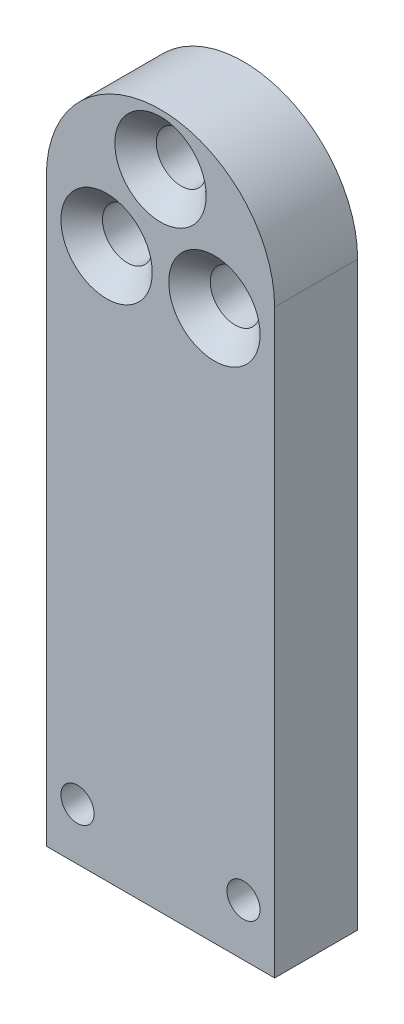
ISO-10303-21;
HEADER;
FILE_DESCRIPTION(('STEP AP214'),'2;1');
FILE_NAME('part.step','',(''),(''),'','','');
FILE_SCHEMA(('AUTOMOTIVE_DESIGN { 1 0 10303 214 1 1 1 1 }'));
ENDSEC;
DATA;
#1=APPLICATION_CONTEXT('core data for automotive mechanical design processes');
#2=APPLICATION_PROTOCOL_DEFINITION('international standard','automotive_design',2000,#1);
#3=PRODUCT_CONTEXT('',#1,'mechanical');
#4=PRODUCT('Part','Part','',(#3));
#5=PRODUCT_RELATED_PRODUCT_CATEGORY('part','',(#4));
#6=PRODUCT_DEFINITION_FORMATION('','',#4);
#7=PRODUCT_DEFINITION_CONTEXT('part definition',#1,'design');
#8=PRODUCT_DEFINITION('design','',#6,#7);
#9=PRODUCT_DEFINITION_SHAPE('','',#8);
#10=(LENGTH_UNIT() NAMED_UNIT(*) SI_UNIT(.MILLI.,.METRE.));
#11=(NAMED_UNIT(*) PLANE_ANGLE_UNIT() SI_UNIT($,.RADIAN.));
#12=(NAMED_UNIT(*) SI_UNIT($,.STERADIAN.) SOLID_ANGLE_UNIT());
#13=UNCERTAINTY_MEASURE_WITH_UNIT(LENGTH_MEASURE(1.E-05),#10,'distance_accuracy_value','');
#14=(GEOMETRIC_REPRESENTATION_CONTEXT(3) GLOBAL_UNCERTAINTY_ASSIGNED_CONTEXT((#13)) GLOBAL_UNIT_ASSIGNED_CONTEXT((#10,
#11,#12)) REPRESENTATION_CONTEXT('',''));
#15=CARTESIAN_POINT('',(0.,0.,0.));
#16=DIRECTION('',(0.,0.,1.));
#17=DIRECTION('',(1.,0.,0.));
#18=AXIS2_PLACEMENT_3D('',#15,#16,#17);
#19=CARTESIAN_POINT('',(0.,0.,4.));
#20=DIRECTION('',(0.,0.,-1.));
#21=DIRECTION('',(-1.,0.,0.));
#22=AXIS2_PLACEMENT_3D('',#19,#20,#21);
#23=CYLINDRICAL_SURFACE('',#22,5.5);
#24=CARTESIAN_POINT('',(0.,0.,0.));
#25=DIRECTION('',(0.,0.,1.));
#26=DIRECTION('',(1.,0.,0.));
#27=AXIS2_PLACEMENT_3D('',#24,#25,#26);
#28=CIRCLE('',#27,5.5);
#29=CARTESIAN_POINT('',(5.5,0.,0.));
#30=VERTEX_POINT('',#29);
#31=CARTESIAN_POINT('',(-5.5,0.,0.));
#32=VERTEX_POINT('',#31);
#33=EDGE_CURVE('E111',#30,#32,#28,.T.);
#34=ORIENTED_EDGE('',*,*,#33,.T.);
#35=DIRECTION('',(0.,0.,-1.));
#36=VECTOR('',#35,1.);
#37=CARTESIAN_POINT('',(-5.5,0.,4.));
#38=LINE('',#37,#36);
#39=CARTESIAN_POINT('',(-5.5,0.,4.));
#40=VERTEX_POINT('',#39);
#41=EDGE_CURVE('E11',#40,#32,#38,.T.);
#42=ORIENTED_EDGE('',*,*,#41,.F.);
#43=CARTESIAN_POINT('',(0.,0.,4.));
#44=DIRECTION('',(0.,0.,1.));
#45=DIRECTION('',(1.,0.,0.));
#46=AXIS2_PLACEMENT_3D('',#43,#44,#45);
#47=CIRCLE('',#46,5.5);
#48=CARTESIAN_POINT('',(5.5,0.,4.));
#49=VERTEX_POINT('',#48);
#50=EDGE_CURVE('E95',#49,#40,#47,.T.);
#51=ORIENTED_EDGE('',*,*,#50,.F.);
#52=DIRECTION('',(0.,0.,-1.));
#53=VECTOR('',#52,1.);
#54=CARTESIAN_POINT('',(5.5,0.,4.));
#55=LINE('',#54,#53);
#56=EDGE_CURVE('E107',#49,#30,#55,.T.);
#57=ORIENTED_EDGE('',*,*,#56,.T.);
#58=EDGE_LOOP('',(#34,#42,#51,#57));
#59=FACE_BOUND('',#58,.T.);
#60=ADVANCED_FACE('F43',(#59),#23,.T.);
#61=CARTESIAN_POINT('',(-5.5,0.,4.));
#62=DIRECTION('',(1.,0.,0.));
#63=DIRECTION('',(0.,1.,0.));
#64=AXIS2_PLACEMENT_3D('',#61,#62,#63);
#65=PLANE('',#64);
#66=DIRECTION('',(0.,-1.,0.));
#67=VECTOR('',#66,1.);
#68=CARTESIAN_POINT('',(-5.5,0.,0.));
#69=LINE('',#68,#67);
#70=CARTESIAN_POINT('',(-5.5,-28.,0.));
#71=VERTEX_POINT('',#70);
#72=EDGE_CURVE('E100',#32,#71,#69,.T.);
#73=ORIENTED_EDGE('',*,*,#72,.T.);
#74=DIRECTION('',(0.,0.,-1.));
#75=VECTOR('',#74,1.);
#76=CARTESIAN_POINT('',(-5.5,-28.,4.));
#77=LINE('',#76,#75);
#78=CARTESIAN_POINT('',(-5.5,-28.,4.));
#79=VERTEX_POINT('',#78);
#80=EDGE_CURVE('E52',#79,#71,#77,.T.);
#81=ORIENTED_EDGE('',*,*,#80,.F.);
#82=DIRECTION('',(0.,-1.,0.));
#83=VECTOR('',#82,1.);
#84=CARTESIAN_POINT('',(-5.5,0.,4.));
#85=LINE('',#84,#83);
#86=EDGE_CURVE('E90',#40,#79,#85,.T.);
#87=ORIENTED_EDGE('',*,*,#86,.F.);
#88=ORIENTED_EDGE('',*,*,#41,.T.);
#89=EDGE_LOOP('',(#73,#81,#87,#88));
#90=FACE_BOUND('',#89,.T.);
#91=ADVANCED_FACE('F99',(#90),#65,.F.);
#92=CARTESIAN_POINT('',(5.5,-28.,4.));
#93=DIRECTION('',(0.,1.,0.));
#94=DIRECTION('',(0.,0.,1.));
#95=AXIS2_PLACEMENT_3D('',#92,#93,#94);
#96=PLANE('',#95);
#97=DIRECTION('',(1.,0.,0.));
#98=VECTOR('',#97,1.);
#99=CARTESIAN_POINT('',(5.5,-28.,0.));
#100=LINE('',#99,#98);
#101=CARTESIAN_POINT('',(5.5,-28.,0.));
#102=VERTEX_POINT('',#101);
#103=EDGE_CURVE('E77',#71,#102,#100,.T.);
#104=ORIENTED_EDGE('',*,*,#103,.T.);
#105=DIRECTION('',(0.,0.,-1.));
#106=VECTOR('',#105,1.);
#107=CARTESIAN_POINT('',(5.5,-28.,4.));
#108=LINE('',#107,#106);
#109=CARTESIAN_POINT('',(5.5,-28.,4.));
#110=VERTEX_POINT('',#109);
#111=EDGE_CURVE('E102',#110,#102,#108,.T.);
#112=ORIENTED_EDGE('',*,*,#111,.F.);
#113=DIRECTION('',(1.,0.,0.));
#114=VECTOR('',#113,1.);
#115=CARTESIAN_POINT('',(5.5,-28.,4.));
#116=LINE('',#115,#114);
#117=EDGE_CURVE('E93',#79,#110,#116,.T.);
#118=ORIENTED_EDGE('',*,*,#117,.F.);
#119=ORIENTED_EDGE('',*,*,#80,.T.);
#120=EDGE_LOOP('',(#104,#112,#118,#119));
#121=FACE_BOUND('',#120,.T.);
#122=ADVANCED_FACE('F103',(#121),#96,.F.);
#123=CARTESIAN_POINT('',(5.5,0.,4.));
#124=DIRECTION('',(-1.,0.,0.));
#125=DIRECTION('',(0.,-1.,0.));
#126=AXIS2_PLACEMENT_3D('',#123,#124,#125);
#127=PLANE('',#126);
#128=DIRECTION('',(0.,1.,0.));
#129=VECTOR('',#128,1.);
#130=CARTESIAN_POINT('',(5.5,0.,0.));
#131=LINE('',#130,#129);
#132=EDGE_CURVE('E83',#102,#30,#131,.T.);
#133=ORIENTED_EDGE('',*,*,#132,.T.);
#134=ORIENTED_EDGE('',*,*,#56,.F.);
#135=DIRECTION('',(0.,1.,0.));
#136=VECTOR('',#135,1.);
#137=CARTESIAN_POINT('',(5.5,0.,4.));
#138=LINE('',#137,#136);
#139=EDGE_CURVE('E60',#110,#49,#138,.T.);
#140=ORIENTED_EDGE('',*,*,#139,.F.);
#141=ORIENTED_EDGE('',*,*,#111,.T.);
#142=EDGE_LOOP('',(#133,#134,#140,#141));
#143=FACE_BOUND('',#142,.T.);
#144=ADVANCED_FACE('F125',(#143),#127,.F.);
#145=CARTESIAN_POINT('',(0.,0.,4.));
#146=DIRECTION('',(0.,0.,1.));
#147=DIRECTION('',(1.,0.,0.));
#148=AXIS2_PLACEMENT_3D('',#145,#146,#147);
#149=PLANE('',#148);
#150=CARTESIAN_POINT('',(2.59807621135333,-1.49999999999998,4.));
#151=DIRECTION('',(0.,0.,1.));
#152=DIRECTION('',(1.,0.,0.));
#153=AXIS2_PLACEMENT_3D('',#150,#151,#152);
#154=CIRCLE('',#153,2.2);
#155=CARTESIAN_POINT('',(4.79807621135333,-1.49999999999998,4.));
#156=VERTEX_POINT('',#155);
#157=EDGE_CURVE('E179',#156,#156,#154,.T.);
#158=ORIENTED_EDGE('',*,*,#157,.F.);
#159=EDGE_LOOP('',(#158));
#160=FACE_BOUND('',#159,.T.);
#161=CARTESIAN_POINT('',(-2.59807621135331,-1.50000000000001,4.));
#162=DIRECTION('',(0.,0.,1.));
#163=DIRECTION('',(1.,0.,0.));
#164=AXIS2_PLACEMENT_3D('',#161,#162,#163);
#165=CIRCLE('',#164,2.2);
#166=CARTESIAN_POINT('',(-0.398076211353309,-1.50000000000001,4.));
#167=VERTEX_POINT('',#166);
#168=EDGE_CURVE('E167',#167,#167,#165,.T.);
#169=ORIENTED_EDGE('',*,*,#168,.F.);
#170=EDGE_LOOP('',(#169));
#171=FACE_BOUND('',#170,.T.);
#172=CARTESIAN_POINT('',(0.,3.,4.));
#173=DIRECTION('',(0.,0.,1.));
#174=DIRECTION('',(1.,0.,0.));
#175=AXIS2_PLACEMENT_3D('',#172,#173,#174);
#176=CIRCLE('',#175,2.2);
#177=CARTESIAN_POINT('',(2.2,3.,4.));
#178=VERTEX_POINT('',#177);
#179=EDGE_CURVE('E155',#178,#178,#176,.T.);
#180=ORIENTED_EDGE('',*,*,#179,.F.);
#181=EDGE_LOOP('',(#180));
#182=FACE_BOUND('',#181,.T.);
#183=CARTESIAN_POINT('',(-4.,-25.5,4.));
#184=DIRECTION('',(0.,0.,1.));
#185=DIRECTION('',(1.,0.,0.));
#186=AXIS2_PLACEMENT_3D('',#183,#184,#185);
#187=CIRCLE('',#186,0.799999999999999);
#188=CARTESIAN_POINT('',(-3.2,-25.5,4.));
#189=VERTEX_POINT('',#188);
#190=EDGE_CURVE('E143',#189,#189,#187,.T.);
#191=ORIENTED_EDGE('',*,*,#190,.F.);
#192=EDGE_LOOP('',(#191));
#193=FACE_BOUND('',#192,.T.);
#194=CARTESIAN_POINT('',(4.,-25.5,4.));
#195=DIRECTION('',(0.,0.,1.));
#196=DIRECTION('',(1.,0.,0.));
#197=AXIS2_PLACEMENT_3D('',#194,#195,#196);
#198=CIRCLE('',#197,0.799999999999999);
#199=CARTESIAN_POINT('',(4.8,-25.5,4.));
#200=VERTEX_POINT('',#199);
#201=EDGE_CURVE('E135',#200,#200,#198,.T.);
#202=ORIENTED_EDGE('',*,*,#201,.F.);
#203=EDGE_LOOP('',(#202));
#204=FACE_BOUND('',#203,.T.);
#205=ORIENTED_EDGE('',*,*,#50,.T.);
#206=ORIENTED_EDGE('',*,*,#86,.T.);
#207=ORIENTED_EDGE('',*,*,#117,.T.);
#208=ORIENTED_EDGE('',*,*,#139,.T.);
#209=EDGE_LOOP('',(#205,#206,#207,#208));
#210=FACE_BOUND('',#209,.T.);
#211=ADVANCED_FACE('F91',(#160,#171,#182,#193,#204,#210),#149,.T.);
#212=CARTESIAN_POINT('',(0.,0.,0.));
#213=DIRECTION('',(0.,0.,1.));
#214=DIRECTION('',(1.,0.,0.));
#215=AXIS2_PLACEMENT_3D('',#212,#213,#214);
#216=PLANE('',#215);
#217=CARTESIAN_POINT('',(2.59807621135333,-1.49999999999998,0.));
#218=DIRECTION('',(0.,0.,1.));
#219=DIRECTION('',(1.,0.,0.));
#220=AXIS2_PLACEMENT_3D('',#217,#218,#219);
#221=CIRCLE('',#220,1.2);
#222=CARTESIAN_POINT('',(3.79807621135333,-1.49999999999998,0.));
#223=VERTEX_POINT('',#222);
#224=EDGE_CURVE('E171',#223,#223,#221,.T.);
#225=ORIENTED_EDGE('',*,*,#224,.T.);
#226=EDGE_LOOP('',(#225));
#227=FACE_BOUND('',#226,.T.);
#228=CARTESIAN_POINT('',(-2.59807621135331,-1.50000000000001,0.));
#229=DIRECTION('',(0.,0.,1.));
#230=DIRECTION('',(1.,0.,0.));
#231=AXIS2_PLACEMENT_3D('',#228,#229,#230);
#232=CIRCLE('',#231,1.2);
#233=CARTESIAN_POINT('',(-1.39807621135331,-1.50000000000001,0.));
#234=VERTEX_POINT('',#233);
#235=EDGE_CURVE('E159',#234,#234,#232,.T.);
#236=ORIENTED_EDGE('',*,*,#235,.T.);
#237=EDGE_LOOP('',(#236));
#238=FACE_BOUND('',#237,.T.);
#239=CARTESIAN_POINT('',(0.,3.,0.));
#240=DIRECTION('',(0.,0.,1.));
#241=DIRECTION('',(1.,0.,0.));
#242=AXIS2_PLACEMENT_3D('',#239,#240,#241);
#243=CIRCLE('',#242,1.2);
#244=CARTESIAN_POINT('',(1.2,3.,0.));
#245=VERTEX_POINT('',#244);
#246=EDGE_CURVE('E147',#245,#245,#243,.T.);
#247=ORIENTED_EDGE('',*,*,#246,.T.);
#248=EDGE_LOOP('',(#247));
#249=FACE_BOUND('',#248,.T.);
#250=CARTESIAN_POINT('',(-4.,-25.5,0.));
#251=DIRECTION('',(0.,0.,1.));
#252=DIRECTION('',(1.,0.,0.));
#253=AXIS2_PLACEMENT_3D('',#250,#251,#252);
#254=CIRCLE('',#253,0.799999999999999);
#255=CARTESIAN_POINT('',(-3.2,-25.5,0.));
#256=VERTEX_POINT('',#255);
#257=EDGE_CURVE('E139',#256,#256,#254,.T.);
#258=ORIENTED_EDGE('',*,*,#257,.T.);
#259=EDGE_LOOP('',(#258));
#260=FACE_BOUND('',#259,.T.);
#261=CARTESIAN_POINT('',(4.,-25.5,0.));
#262=DIRECTION('',(0.,0.,1.));
#263=DIRECTION('',(1.,0.,0.));
#264=AXIS2_PLACEMENT_3D('',#261,#262,#263);
#265=CIRCLE('',#264,0.799999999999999);
#266=CARTESIAN_POINT('',(4.8,-25.5,0.));
#267=VERTEX_POINT('',#266);
#268=EDGE_CURVE('E115',#267,#267,#265,.T.);
#269=ORIENTED_EDGE('',*,*,#268,.T.);
#270=EDGE_LOOP('',(#269));
#271=FACE_BOUND('',#270,.T.);
#272=ORIENTED_EDGE('',*,*,#33,.F.);
#273=ORIENTED_EDGE('',*,*,#132,.F.);
#274=ORIENTED_EDGE('',*,*,#103,.F.);
#275=ORIENTED_EDGE('',*,*,#72,.F.);
#276=EDGE_LOOP('',(#272,#273,#274,#275));
#277=FACE_BOUND('',#276,.T.);
#278=ADVANCED_FACE('F128',(#227,#238,#249,#260,#271,#277),#216,.F.);
#279=CARTESIAN_POINT('',(4.,-25.5,4.));
#280=DIRECTION('',(0.,0.,1.));
#281=DIRECTION('',(1.,0.,0.));
#282=AXIS2_PLACEMENT_3D('',#279,#280,#281);
#283=CYLINDRICAL_SURFACE('',#282,0.799999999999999);
#284=ORIENTED_EDGE('',*,*,#268,.F.);
#285=EDGE_LOOP('',(#284));
#286=FACE_BOUND('',#285,.T.);
#287=ORIENTED_EDGE('',*,*,#201,.T.);
#288=EDGE_LOOP('',(#287));
#289=FACE_BOUND('',#288,.T.);
#290=ADVANCED_FACE('F197',(#286,#289),#283,.F.);
#291=CARTESIAN_POINT('',(-4.,-25.5,4.));
#292=DIRECTION('',(0.,0.,1.));
#293=DIRECTION('',(1.,0.,0.));
#294=AXIS2_PLACEMENT_3D('',#291,#292,#293);
#295=CYLINDRICAL_SURFACE('',#294,0.799999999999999);
#296=ORIENTED_EDGE('',*,*,#257,.F.);
#297=EDGE_LOOP('',(#296));
#298=FACE_BOUND('',#297,.T.);
#299=ORIENTED_EDGE('',*,*,#190,.T.);
#300=EDGE_LOOP('',(#299));
#301=FACE_BOUND('',#300,.T.);
#302=ADVANCED_FACE('F199',(#298,#301),#295,.F.);
#303=CARTESIAN_POINT('',(0.,3.,4.));
#304=DIRECTION('',(0.,0.,1.));
#305=DIRECTION('',(1.,0.,0.));
#306=AXIS2_PLACEMENT_3D('',#303,#304,#305);
#307=CYLINDRICAL_SURFACE('',#306,1.2);
#308=ORIENTED_EDGE('',*,*,#246,.F.);
#309=EDGE_LOOP('',(#308));
#310=FACE_BOUND('',#309,.T.);
#311=CARTESIAN_POINT('',(0.,3.,3.));
#312=DIRECTION('',(0.,0.,1.));
#313=DIRECTION('',(1.,0.,0.));
#314=AXIS2_PLACEMENT_3D('',#311,#312,#313);
#315=CIRCLE('',#314,1.2);
#316=CARTESIAN_POINT('',(1.2,3.,3.));
#317=VERTEX_POINT('',#316);
#318=EDGE_CURVE('E151',#317,#317,#315,.T.);
#319=ORIENTED_EDGE('',*,*,#318,.T.);
#320=EDGE_LOOP('',(#319));
#321=FACE_BOUND('',#320,.T.);
#322=ADVANCED_FACE('F206',(#310,#321),#307,.F.);
#323=CARTESIAN_POINT('',(0.,3.,4.));
#324=DIRECTION('',(0.,0.,1.));
#325=DIRECTION('',(1.,0.,0.));
#326=AXIS2_PLACEMENT_3D('',#323,#324,#325);
#327=CONICAL_SURFACE('',#326,2.2,0.785398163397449);
#328=ORIENTED_EDGE('',*,*,#318,.F.);
#329=EDGE_LOOP('',(#328));
#330=FACE_BOUND('',#329,.T.);
#331=ORIENTED_EDGE('',*,*,#179,.T.);
#332=EDGE_LOOP('',(#331));
#333=FACE_BOUND('',#332,.T.);
#334=ADVANCED_FACE('F249',(#330,#333),#327,.F.);
#335=CARTESIAN_POINT('',(-2.59807621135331,-1.50000000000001,4.));
#336=DIRECTION('',(0.,0.,1.));
#337=DIRECTION('',(1.,0.,0.));
#338=AXIS2_PLACEMENT_3D('',#335,#336,#337);
#339=CYLINDRICAL_SURFACE('',#338,1.2);
#340=ORIENTED_EDGE('',*,*,#235,.F.);
#341=EDGE_LOOP('',(#340));
#342=FACE_BOUND('',#341,.T.);
#343=CARTESIAN_POINT('',(-2.59807621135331,-1.50000000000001,3.));
#344=DIRECTION('',(0.,0.,1.));
#345=DIRECTION('',(1.,0.,0.));
#346=AXIS2_PLACEMENT_3D('',#343,#344,#345);
#347=CIRCLE('',#346,1.2);
#348=CARTESIAN_POINT('',(-1.39807621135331,-1.50000000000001,3.));
#349=VERTEX_POINT('',#348);
#350=EDGE_CURVE('E163',#349,#349,#347,.T.);
#351=ORIENTED_EDGE('',*,*,#350,.T.);
#352=EDGE_LOOP('',(#351));
#353=FACE_BOUND('',#352,.T.);
#354=ADVANCED_FACE('F243',(#342,#353),#339,.F.);
#355=CARTESIAN_POINT('',(-2.59807621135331,-1.50000000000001,4.));
#356=DIRECTION('',(0.,0.,1.));
#357=DIRECTION('',(1.,0.,0.));
#358=AXIS2_PLACEMENT_3D('',#355,#356,#357);
#359=CONICAL_SURFACE('',#358,2.2,0.785398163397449);
#360=ORIENTED_EDGE('',*,*,#350,.F.);
#361=EDGE_LOOP('',(#360));
#362=FACE_BOUND('',#361,.T.);
#363=ORIENTED_EDGE('',*,*,#168,.T.);
#364=EDGE_LOOP('',(#363));
#365=FACE_BOUND('',#364,.T.);
#366=ADVANCED_FACE('F248',(#362,#365),#359,.F.);
#367=CARTESIAN_POINT('',(2.59807621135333,-1.49999999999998,4.));
#368=DIRECTION('',(0.,0.,1.));
#369=DIRECTION('',(1.,0.,0.));
#370=AXIS2_PLACEMENT_3D('',#367,#368,#369);
#371=CYLINDRICAL_SURFACE('',#370,1.2);
#372=ORIENTED_EDGE('',*,*,#224,.F.);
#373=EDGE_LOOP('',(#372));
#374=FACE_BOUND('',#373,.T.);
#375=CARTESIAN_POINT('',(2.59807621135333,-1.49999999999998,3.));
#376=DIRECTION('',(0.,0.,1.));
#377=DIRECTION('',(1.,0.,0.));
#378=AXIS2_PLACEMENT_3D('',#375,#376,#377);
#379=CIRCLE('',#378,1.2);
#380=CARTESIAN_POINT('',(3.79807621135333,-1.49999999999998,3.));
#381=VERTEX_POINT('',#380);
#382=EDGE_CURVE('E175',#381,#381,#379,.T.);
#383=ORIENTED_EDGE('',*,*,#382,.T.);
#384=EDGE_LOOP('',(#383));
#385=FACE_BOUND('',#384,.T.);
#386=ADVANCED_FACE('F261',(#374,#385),#371,.F.);
#387=CARTESIAN_POINT('',(2.59807621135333,-1.49999999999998,4.));
#388=DIRECTION('',(0.,0.,1.));
#389=DIRECTION('',(1.,0.,0.));
#390=AXIS2_PLACEMENT_3D('',#387,#388,#389);
#391=CONICAL_SURFACE('',#390,2.2,0.785398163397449);
#392=ORIENTED_EDGE('',*,*,#382,.F.);
#393=EDGE_LOOP('',(#392));
#394=FACE_BOUND('',#393,.T.);
#395=ORIENTED_EDGE('',*,*,#157,.T.);
#396=EDGE_LOOP('',(#395));
#397=FACE_BOUND('',#396,.T.);
#398=ADVANCED_FACE('F184',(#394,#397),#391,.F.);
#399=CLOSED_SHELL('',(#60,#91,#122,#144,#211,#278,#290,#302,#322,#334,#354,#366,#386,#398));
#400=MANIFOLD_SOLID_BREP('B2',#399);
#401=ADVANCED_BREP_SHAPE_REPRESENTATION('',(#18,#400),#14);
#402=SHAPE_DEFINITION_REPRESENTATION(#9,#401);
ENDSEC;
END-ISO-10303-21;
